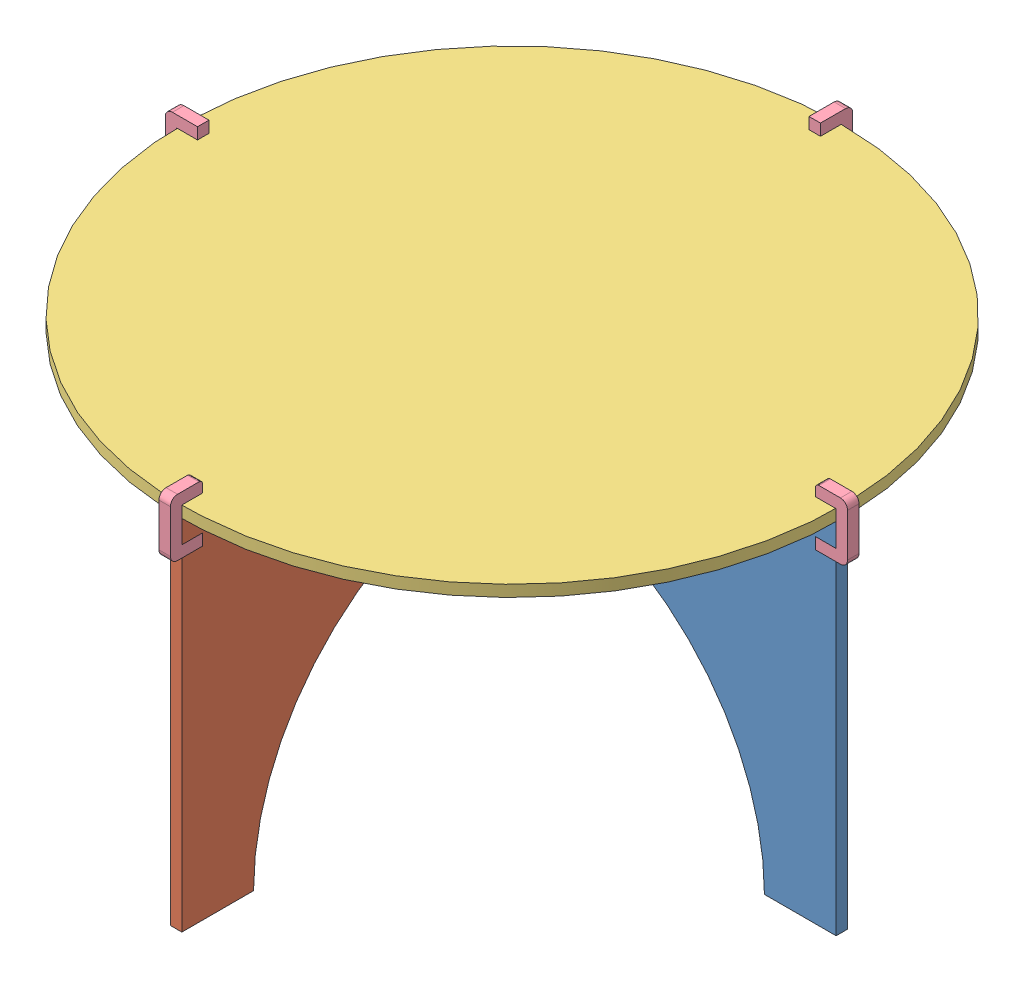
SolidWorks assembly Assem1.SLDASM, configuration Default (file format 9000). Lengths in mm.
Overall size (952 532.09 952).
7 component instances, 4 part files, 17 mates.
Components (placement in the parent):
- Part1-2: Part1.SLDPRT [Default] at (176.6876 -214.9984 920) size (920 500 16)
- Part2-2: Part2.SLDPRT [Default] at (-52.81 -1.1765 958.9262) x (0 0 -1) z (1 0 0) size (920 500 16)
- part3-5: part3.SLDPRT [Default] at (-35.8854 138.8235 928.0009) size (920 16 920)
- part4-2: part4.SLDPRT [Default] at (-36.81 139.7202 1357.515) x (0 0 1) z (-1 0 0) size (45 80.09 16)
- part4-3: part4.SLDPRT [Default] at (-36.81 122.0207 498.485) x (0 0 -1) z (-1 0 0) size (45 80.09 16)
- part4-4: part4.SLDPRT [Default] at (393.5601 139.7202 920) size (45 80.09 16)
- part4-5: part4.SLDPRT [Default] at (-465.47 122.0207 920) x (-1 0 0) z (0 0 1) size (45 80.09 16)
Mates (geometry in assembly coordinates):
- Coincident1: coincident anti-aligned: plane of Part2-2 through (-36.81 -1.1765 958.9262) normal (1 0 0); plane of Part1-2 through (-36.81 68.8235 936) normal (-1 0 0)
- Coincident2: coincident anti-aligned: plane of Part1-2 through (-52.81 68.8235 936) normal (0 -1 0); plane of Part2-2 through (-36.81 68.8235 958.9262) normal (0 1 0)
- Coincident3: coincident anti-aligned: plane of Part1-2 through (-35.955 -360.782 936) normal (0 0 1); plane of Part2-2 through (-36.81 -1.1765 936) normal (0 0 -1)
- Coincident16: coincident aligned: point of Part2-2; circle of part3-5
- Coincident18: coincident: point of Part1-2; circle of part3-5
- Coincident42: coincident aligned: plane of Part2-2 through (-36.81 -1.1765 958.9262) normal (1 0 0); plane of part4-2 through (-36.81 139.7202 1357.515) normal (1 0 0)
- Coincident43: coincident anti-aligned: plane of Part2-2 through (-36.81 106.8235 1359) normal (0 0 1); plane of part4-2 through (-52.81 106.8235 1359) normal (0 0 -1)
- Coincident44: coincident anti-aligned: plane of Part2-2 through (-36.81 90.8235 1388) normal (0 1 0); plane of part4-2 through (-52.81 90.8235 1359) normal (0 -1 0)
- Coincident45: coincident aligned: plane of Part2-2 through (-52.81 -1.1765 958.9262) normal (-1 0 0); plane of part4-3 through (-52.81 122.0207 498.485) normal (-1 0 0)
- Coincident46: coincident anti-aligned: plane of Part2-2 through (-36.81 106.8235 497) normal (0 0 -1); plane of part4-3 through (-52.81 90.8235 497) normal (0 0 1)
- Coincident47: coincident anti-aligned: plane of Part2-2 through (-36.81 90.8235 468) normal (0 1 0); plane of part4-3 through (-52.81 90.8235 497) normal (0 -1 0)
- Coincident48: coincident aligned: plane of Part1-2 through (-35.955 -360.782 920) normal (0 0 -1); plane of part4-4 through (393.5601 139.7202 920) normal (0 0 -1)
- Coincident49: coincident anti-aligned: plane of Part1-2 through (395.045 90.8235 920) normal (0 1 0); plane of part4-4 through (395.045 90.8235 936) normal (0 -1 0)
- Coincident50: coincident anti-aligned: plane of Part1-2 through (395.045 106.8235 920) normal (1 0 0); plane of part4-4 through (395.045 106.8235 936) normal (-1 0 0)
- Coincident51: coincident aligned: plane of Part1-2 through (-35.955 -360.782 920) normal (0 0 -1); plane of part4-5 through (-465.47 122.0207 920) normal (0 0 -1)
- Coincident53: coincident anti-aligned: plane of Part1-2 through (-466.955 106.8235 920) normal (-1 0 0); plane of part4-5 through (-466.955 90.8235 936) normal (1 0 0)
- Coincident54: coincident anti-aligned: plane of Part1-2 through (-495.955 90.8235 920) normal (0 1 0); plane of part4-5 through (-466.955 90.8235 936) normal (0 -1 0)
